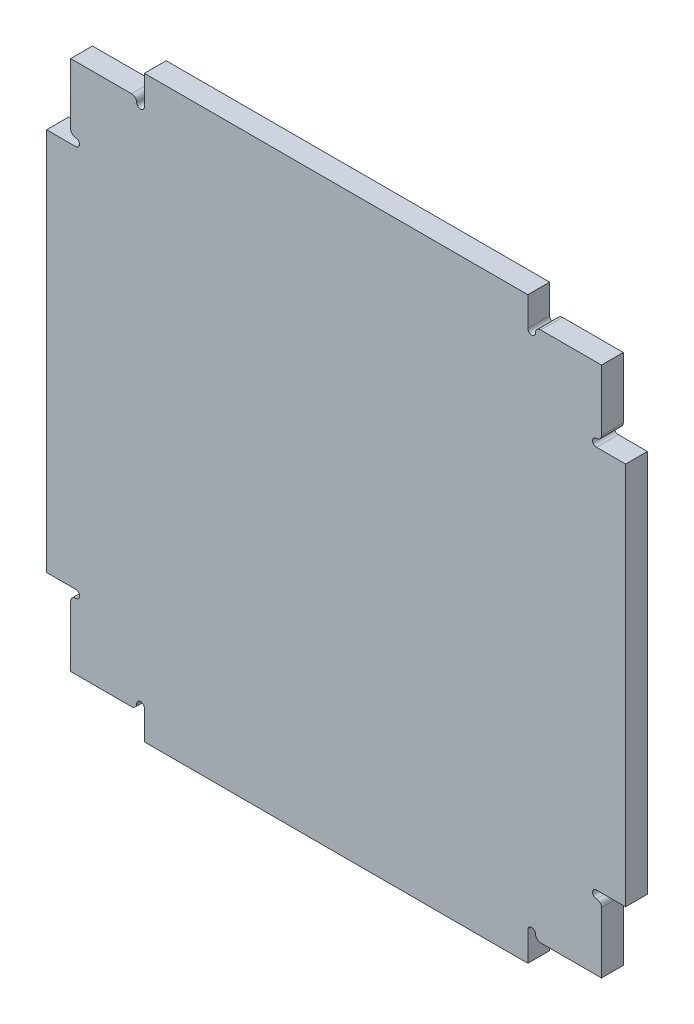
ISO-10303-21;
HEADER;
FILE_DESCRIPTION(('STEP AP214'),'2;1');
FILE_NAME('part.step','',(''),(''),'','','');
FILE_SCHEMA(('AUTOMOTIVE_DESIGN { 1 0 10303 214 1 1 1 1 }'));
ENDSEC;
DATA;
#1=APPLICATION_CONTEXT('core data for automotive mechanical design processes');
#2=APPLICATION_PROTOCOL_DEFINITION('international standard','automotive_design',2000,#1);
#3=PRODUCT_CONTEXT('',#1,'mechanical');
#4=PRODUCT('Part','Part','',(#3));
#5=PRODUCT_RELATED_PRODUCT_CATEGORY('part','',(#4));
#6=PRODUCT_DEFINITION_FORMATION('','',#4);
#7=PRODUCT_DEFINITION_CONTEXT('part definition',#1,'design');
#8=PRODUCT_DEFINITION('design','',#6,#7);
#9=PRODUCT_DEFINITION_SHAPE('','',#8);
#10=(LENGTH_UNIT() NAMED_UNIT(*) SI_UNIT(.MILLI.,.METRE.));
#11=(NAMED_UNIT(*) PLANE_ANGLE_UNIT() SI_UNIT($,.RADIAN.));
#12=(NAMED_UNIT(*) SI_UNIT($,.STERADIAN.) SOLID_ANGLE_UNIT());
#13=UNCERTAINTY_MEASURE_WITH_UNIT(LENGTH_MEASURE(1.E-05),#10,'distance_accuracy_value','');
#14=(GEOMETRIC_REPRESENTATION_CONTEXT(3) GLOBAL_UNCERTAINTY_ASSIGNED_CONTEXT((#13)) GLOBAL_UNIT_ASSIGNED_CONTEXT((#10,
#11,#12)) REPRESENTATION_CONTEXT('',''));
#15=CARTESIAN_POINT('',(0.,0.,0.));
#16=DIRECTION('',(0.,0.,1.));
#17=DIRECTION('',(1.,0.,0.));
#18=AXIS2_PLACEMENT_3D('',#15,#16,#17);
#19=CARTESIAN_POINT('',(-207.509638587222,0.,17.));
#20=DIRECTION('',(1.,0.,0.));
#21=DIRECTION('',(0.,0.,-1.));
#22=AXIS2_PLACEMENT_3D('',#19,#20,#21);
#23=PLANE('',#22);
#24=DIRECTION('',(0.,-1.,0.));
#25=VECTOR('',#24,1.);
#26=CARTESIAN_POINT('',(-207.509638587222,0.,0.));
#27=LINE('',#26,#25);
#28=CARTESIAN_POINT('',(-207.509638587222,-412.621529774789,0.));
#29=VERTEX_POINT('',#28);
#30=CARTESIAN_POINT('',(-207.509638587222,-460.121529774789,0.));
#31=VERTEX_POINT('',#30);
#32=EDGE_CURVE('E297',#29,#31,#27,.T.);
#33=ORIENTED_EDGE('',*,*,#32,.T.);
#34=DIRECTION('',(0.,0.,-1.));
#35=VECTOR('',#34,1.);
#36=CARTESIAN_POINT('',(-207.509638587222,-460.121529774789,17.));
#37=LINE('',#36,#35);
#38=CARTESIAN_POINT('',(-207.509638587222,-460.121529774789,17.));
#39=VERTEX_POINT('',#38);
#40=EDGE_CURVE('E11',#39,#31,#37,.T.);
#41=ORIENTED_EDGE('',*,*,#40,.F.);
#42=DIRECTION('',(0.,-1.,0.));
#43=VECTOR('',#42,1.);
#44=CARTESIAN_POINT('',(-207.509638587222,0.,17.));
#45=LINE('',#44,#43);
#46=CARTESIAN_POINT('',(-207.509638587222,-412.621529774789,17.));
#47=VERTEX_POINT('',#46);
#48=EDGE_CURVE('E393',#47,#39,#45,.T.);
#49=ORIENTED_EDGE('',*,*,#48,.F.);
#50=DIRECTION('',(0.,0.,-1.));
#51=VECTOR('',#50,1.);
#52=CARTESIAN_POINT('',(-207.509638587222,-412.621529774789,17.));
#53=LINE('',#52,#51);
#54=EDGE_CURVE('E293',#47,#29,#53,.T.);
#55=ORIENTED_EDGE('',*,*,#54,.T.);
#56=EDGE_LOOP('',(#33,#41,#49,#55));
#57=FACE_BOUND('',#56,.T.);
#58=ADVANCED_FACE('F34',(#57),#23,.F.);
#59=CARTESIAN_POINT('',(0.,-460.121529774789,17.));
#60=DIRECTION('',(0.,1.,0.));
#61=DIRECTION('',(0.,0.,1.));
#62=AXIS2_PLACEMENT_3D('',#59,#60,#61);
#63=PLANE('',#62);
#64=DIRECTION('',(1.,0.,0.));
#65=VECTOR('',#64,1.);
#66=CARTESIAN_POINT('',(0.,-460.121529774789,0.));
#67=LINE('',#66,#65);
#68=CARTESIAN_POINT('',(-160.009638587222,-460.121529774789,0.));
#69=VERTEX_POINT('',#68);
#70=EDGE_CURVE('E300',#31,#69,#67,.T.);
#71=ORIENTED_EDGE('',*,*,#70,.T.);
#72=DIRECTION('',(0.,0.,-1.));
#73=VECTOR('',#72,1.);
#74=CARTESIAN_POINT('',(-160.009638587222,-460.121529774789,17.));
#75=LINE('',#74,#73);
#76=CARTESIAN_POINT('',(-160.009638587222,-460.121529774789,17.));
#77=VERTEX_POINT('',#76);
#78=EDGE_CURVE('E42',#77,#69,#75,.T.);
#79=ORIENTED_EDGE('',*,*,#78,.F.);
#80=DIRECTION('',(1.,0.,0.));
#81=VECTOR('',#80,1.);
#82=CARTESIAN_POINT('',(0.,-460.121529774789,17.));
#83=LINE('',#82,#81);
#84=EDGE_CURVE('E173',#39,#77,#83,.T.);
#85=ORIENTED_EDGE('',*,*,#84,.F.);
#86=ORIENTED_EDGE('',*,*,#40,.T.);
#87=EDGE_LOOP('',(#71,#79,#85,#86));
#88=FACE_BOUND('',#87,.T.);
#89=ADVANCED_FACE('F577',(#88),#63,.F.);
#90=CARTESIAN_POINT('',(-160.009638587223,-456.16447714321,17.));
#91=DIRECTION('',(0.,0.,-1.));
#92=DIRECTION('',(-1.,0.,0.));
#93=AXIS2_PLACEMENT_3D('',#90,#91,#92);
#94=CYLINDRICAL_SURFACE('',#93,3.95705263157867);
#95=CARTESIAN_POINT('',(-160.009638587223,-456.16447714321,0.));
#96=DIRECTION('',(0.,0.,1.));
#97=DIRECTION('',(1.,0.,0.));
#98=AXIS2_PLACEMENT_3D('',#95,#96,#97);
#99=CIRCLE('',#98,3.95705263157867);
#100=CARTESIAN_POINT('',(-156.052585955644,-456.16447714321,0.));
#101=VERTEX_POINT('',#100);
#102=EDGE_CURVE('E302',#69,#101,#99,.T.);
#103=ORIENTED_EDGE('',*,*,#102,.T.);
#104=DIRECTION('',(0.,0.,-1.));
#105=VECTOR('',#104,1.);
#106=CARTESIAN_POINT('',(-156.052585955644,-456.16447714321,17.));
#107=LINE('',#106,#105);
#108=CARTESIAN_POINT('',(-156.052585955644,-456.16447714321,17.));
#109=VERTEX_POINT('',#108);
#110=EDGE_CURVE('E460',#109,#101,#107,.T.);
#111=ORIENTED_EDGE('',*,*,#110,.F.);
#112=CARTESIAN_POINT('',(-160.009638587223,-456.16447714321,17.));
#113=DIRECTION('',(0.,0.,1.));
#114=DIRECTION('',(1.,0.,0.));
#115=AXIS2_PLACEMENT_3D('',#112,#113,#114);
#116=CIRCLE('',#115,3.95705263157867);
#117=EDGE_CURVE('E467',#77,#109,#116,.T.);
#118=ORIENTED_EDGE('',*,*,#117,.F.);
#119=ORIENTED_EDGE('',*,*,#78,.T.);
#120=EDGE_LOOP('',(#103,#111,#118,#119));
#121=FACE_BOUND('',#120,.T.);
#122=ADVANCED_FACE('F465',(#121),#94,.T.);
#123=CARTESIAN_POINT('',(-153.052585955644,-456.16447714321,17.));
#124=DIRECTION('',(0.,0.,-1.));
#125=DIRECTION('',(-1.,0.,0.));
#126=AXIS2_PLACEMENT_3D('',#123,#124,#125);
#127=CYLINDRICAL_SURFACE('',#126,3.);
#128=CARTESIAN_POINT('',(-153.052585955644,-456.16447714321,0.));
#129=DIRECTION('',(0.,0.,1.));
#130=DIRECTION('',(1.,0.,0.));
#131=AXIS2_PLACEMENT_3D('',#128,#129,#130);
#132=CIRCLE('',#131,3.);
#133=CARTESIAN_POINT('',(-150.052585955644,-456.16447714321,0.));
#134=VERTEX_POINT('',#133);
#135=EDGE_CURVE('E305',#134,#101,#132,.T.);
#136=ORIENTED_EDGE('',*,*,#135,.F.);
#137=DIRECTION('',(0.,0.,-1.));
#138=VECTOR('',#137,1.);
#139=CARTESIAN_POINT('',(-150.052585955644,-456.16447714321,17.));
#140=LINE('',#139,#138);
#141=CARTESIAN_POINT('',(-150.052585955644,-456.16447714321,17.));
#142=VERTEX_POINT('',#141);
#143=EDGE_CURVE('E458',#142,#134,#140,.T.);
#144=ORIENTED_EDGE('',*,*,#143,.F.);
#145=CARTESIAN_POINT('',(-153.052585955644,-456.16447714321,17.));
#146=DIRECTION('',(0.,0.,1.));
#147=DIRECTION('',(1.,0.,0.));
#148=AXIS2_PLACEMENT_3D('',#145,#146,#147);
#149=CIRCLE('',#148,3.);
#150=EDGE_CURVE('E478',#142,#109,#149,.T.);
#151=ORIENTED_EDGE('',*,*,#150,.T.);
#152=ORIENTED_EDGE('',*,*,#110,.T.);
#153=EDGE_LOOP('',(#136,#144,#151,#152));
#154=FACE_BOUND('',#153,.T.);
#155=ADVANCED_FACE('F474',(#154),#127,.F.);
#156=CARTESIAN_POINT('',(-150.052585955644,0.,17.));
#157=DIRECTION('',(1.,0.,0.));
#158=DIRECTION('',(0.,0.,-1.));
#159=AXIS2_PLACEMENT_3D('',#156,#157,#158);
#160=PLANE('',#159);
#161=DIRECTION('',(0.,-1.,0.));
#162=VECTOR('',#161,1.);
#163=CARTESIAN_POINT('',(-150.052585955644,0.,0.));
#164=LINE('',#163,#162);
#165=CARTESIAN_POINT('',(-150.052585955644,-478.917529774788,0.));
#166=VERTEX_POINT('',#165);
#167=EDGE_CURVE('E308',#134,#166,#164,.T.);
#168=ORIENTED_EDGE('',*,*,#167,.T.);
#169=DIRECTION('',(0.,0.,-1.));
#170=VECTOR('',#169,1.);
#171=CARTESIAN_POINT('',(-150.052585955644,-478.917529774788,17.));
#172=LINE('',#171,#170);
#173=CARTESIAN_POINT('',(-150.052585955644,-478.917529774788,17.));
#174=VERTEX_POINT('',#173);
#175=EDGE_CURVE('E456',#174,#166,#172,.T.);
#176=ORIENTED_EDGE('',*,*,#175,.F.);
#177=DIRECTION('',(0.,-1.,0.));
#178=VECTOR('',#177,1.);
#179=CARTESIAN_POINT('',(-150.052585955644,0.,17.));
#180=LINE('',#179,#178);
#181=EDGE_CURVE('E479',#142,#174,#180,.T.);
#182=ORIENTED_EDGE('',*,*,#181,.F.);
#183=ORIENTED_EDGE('',*,*,#143,.T.);
#184=EDGE_LOOP('',(#168,#176,#182,#183));
#185=FACE_BOUND('',#184,.T.);
#186=ADVANCED_FACE('F588',(#185),#160,.F.);
#187=CARTESIAN_POINT('',(0.,-478.917529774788,17.));
#188=DIRECTION('',(0.,-1.,0.));
#189=DIRECTION('',(0.,0.,-1.));
#190=AXIS2_PLACEMENT_3D('',#187,#188,#189);
#191=PLANE('',#190);
#192=DIRECTION('',(-1.,0.,0.));
#193=VECTOR('',#192,1.);
#194=CARTESIAN_POINT('',(0.,-478.917529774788,0.));
#195=LINE('',#194,#193);
#196=CARTESIAN_POINT('',(148.947414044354,-478.917529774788,0.));
#197=VERTEX_POINT('',#196);
#198=EDGE_CURVE('E311',#197,#166,#195,.T.);
#199=ORIENTED_EDGE('',*,*,#198,.F.);
#200=DIRECTION('',(0.,0.,-1.));
#201=VECTOR('',#200,1.);
#202=CARTESIAN_POINT('',(148.947414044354,-478.917529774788,17.));
#203=LINE('',#202,#201);
#204=CARTESIAN_POINT('',(148.947414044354,-478.917529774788,17.));
#205=VERTEX_POINT('',#204);
#206=EDGE_CURVE('E454',#205,#197,#203,.T.);
#207=ORIENTED_EDGE('',*,*,#206,.F.);
#208=DIRECTION('',(-1.,0.,0.));
#209=VECTOR('',#208,1.);
#210=CARTESIAN_POINT('',(0.,-478.917529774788,17.));
#211=LINE('',#210,#209);
#212=EDGE_CURVE('E481',#205,#174,#211,.T.);
#213=ORIENTED_EDGE('',*,*,#212,.T.);
#214=ORIENTED_EDGE('',*,*,#175,.T.);
#215=EDGE_LOOP('',(#199,#207,#213,#214));
#216=FACE_BOUND('',#215,.T.);
#217=ADVANCED_FACE('F591',(#216),#191,.T.);
#218=CARTESIAN_POINT('',(148.947414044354,0.,17.));
#219=DIRECTION('',(1.,0.,0.));
#220=DIRECTION('',(0.,0.,-1.));
#221=AXIS2_PLACEMENT_3D('',#218,#219,#220);
#222=PLANE('',#221);
#223=DIRECTION('',(0.,-1.,0.));
#224=VECTOR('',#223,1.);
#225=CARTESIAN_POINT('',(148.947414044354,0.,0.));
#226=LINE('',#225,#224);
#227=CARTESIAN_POINT('',(148.947414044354,-456.16447714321,0.));
#228=VERTEX_POINT('',#227);
#229=EDGE_CURVE('E314',#228,#197,#226,.T.);
#230=ORIENTED_EDGE('',*,*,#229,.F.);
#231=DIRECTION('',(0.,0.,-1.));
#232=VECTOR('',#231,1.);
#233=CARTESIAN_POINT('',(148.947414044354,-456.16447714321,17.));
#234=LINE('',#233,#232);
#235=CARTESIAN_POINT('',(148.947414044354,-456.16447714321,17.));
#236=VERTEX_POINT('',#235);
#237=EDGE_CURVE('E452',#236,#228,#234,.T.);
#238=ORIENTED_EDGE('',*,*,#237,.F.);
#239=DIRECTION('',(0.,-1.,0.));
#240=VECTOR('',#239,1.);
#241=CARTESIAN_POINT('',(148.947414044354,0.,17.));
#242=LINE('',#241,#240);
#243=EDGE_CURVE('E488',#236,#205,#242,.T.);
#244=ORIENTED_EDGE('',*,*,#243,.T.);
#245=ORIENTED_EDGE('',*,*,#206,.T.);
#246=EDGE_LOOP('',(#230,#238,#244,#245));
#247=FACE_BOUND('',#246,.T.);
#248=ADVANCED_FACE('F595',(#247),#222,.T.);
#249=CARTESIAN_POINT('',(151.947414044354,-456.16447714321,17.));
#250=DIRECTION('',(0.,0.,-1.));
#251=DIRECTION('',(-1.,0.,0.));
#252=AXIS2_PLACEMENT_3D('',#249,#250,#251);
#253=CYLINDRICAL_SURFACE('',#252,3.);
#254=CARTESIAN_POINT('',(151.947414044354,-456.16447714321,0.));
#255=DIRECTION('',(0.,0.,1.));
#256=DIRECTION('',(1.,0.,0.));
#257=AXIS2_PLACEMENT_3D('',#254,#255,#256);
#258=CIRCLE('',#257,3.);
#259=CARTESIAN_POINT('',(154.947414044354,-456.16447714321,0.));
#260=VERTEX_POINT('',#259);
#261=EDGE_CURVE('E317',#228,#260,#258,.F.);
#262=ORIENTED_EDGE('',*,*,#261,.T.);
#263=DIRECTION('',(0.,0.,-1.));
#264=VECTOR('',#263,1.);
#265=CARTESIAN_POINT('',(154.947414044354,-456.16447714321,17.));
#266=LINE('',#265,#264);
#267=CARTESIAN_POINT('',(154.947414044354,-456.16447714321,17.));
#268=VERTEX_POINT('',#267);
#269=EDGE_CURVE('E450',#268,#260,#266,.T.);
#270=ORIENTED_EDGE('',*,*,#269,.F.);
#271=CARTESIAN_POINT('',(151.947414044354,-456.16447714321,17.));
#272=DIRECTION('',(0.,0.,1.));
#273=DIRECTION('',(1.,0.,0.));
#274=AXIS2_PLACEMENT_3D('',#271,#272,#273);
#275=CIRCLE('',#274,3.);
#276=EDGE_CURVE('E491',#236,#268,#275,.F.);
#277=ORIENTED_EDGE('',*,*,#276,.F.);
#278=ORIENTED_EDGE('',*,*,#237,.T.);
#279=EDGE_LOOP('',(#262,#270,#277,#278));
#280=FACE_BOUND('',#279,.T.);
#281=ADVANCED_FACE('F599',(#280),#253,.F.);
#282=CARTESIAN_POINT('',(158.904466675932,-456.16447714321,17.));
#283=DIRECTION('',(0.,0.,-1.));
#284=DIRECTION('',(-1.,0.,0.));
#285=AXIS2_PLACEMENT_3D('',#282,#283,#284);
#286=CYLINDRICAL_SURFACE('',#285,3.95705263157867);
#287=CARTESIAN_POINT('',(158.904466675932,-456.16447714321,0.));
#288=DIRECTION('',(0.,0.,1.));
#289=DIRECTION('',(1.,0.,0.));
#290=AXIS2_PLACEMENT_3D('',#287,#288,#289);
#291=CIRCLE('',#290,3.95705263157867);
#292=CARTESIAN_POINT('',(158.904466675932,-460.121529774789,0.));
#293=VERTEX_POINT('',#292);
#294=EDGE_CURVE('E320',#293,#260,#291,.F.);
#295=ORIENTED_EDGE('',*,*,#294,.F.);
#296=DIRECTION('',(0.,0.,-1.));
#297=VECTOR('',#296,1.);
#298=CARTESIAN_POINT('',(158.904466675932,-460.121529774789,17.));
#299=LINE('',#298,#297);
#300=CARTESIAN_POINT('',(158.904466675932,-460.121529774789,17.));
#301=VERTEX_POINT('',#300);
#302=EDGE_CURVE('E448',#301,#293,#299,.T.);
#303=ORIENTED_EDGE('',*,*,#302,.F.);
#304=CARTESIAN_POINT('',(158.904466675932,-456.16447714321,17.));
#305=DIRECTION('',(0.,0.,1.));
#306=DIRECTION('',(1.,0.,0.));
#307=AXIS2_PLACEMENT_3D('',#304,#305,#306);
#308=CIRCLE('',#307,3.95705263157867);
#309=EDGE_CURVE('E493',#301,#268,#308,.F.);
#310=ORIENTED_EDGE('',*,*,#309,.T.);
#311=ORIENTED_EDGE('',*,*,#269,.T.);
#312=EDGE_LOOP('',(#295,#303,#310,#311));
#313=FACE_BOUND('',#312,.T.);
#314=ADVANCED_FACE('F603',(#313),#286,.T.);
#315=CARTESIAN_POINT('',(0.,-460.121529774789,17.));
#316=DIRECTION('',(0.,-1.,0.));
#317=DIRECTION('',(0.,0.,-1.));
#318=AXIS2_PLACEMENT_3D('',#315,#316,#317);
#319=PLANE('',#318);
#320=DIRECTION('',(-1.,0.,0.));
#321=VECTOR('',#320,1.);
#322=CARTESIAN_POINT('',(0.,-460.121529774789,0.));
#323=LINE('',#322,#321);
#324=CARTESIAN_POINT('',(206.404466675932,-460.121529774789,0.));
#325=VERTEX_POINT('',#324);
#326=EDGE_CURVE('E323',#325,#293,#323,.T.);
#327=ORIENTED_EDGE('',*,*,#326,.F.);
#328=DIRECTION('',(0.,0.,-1.));
#329=VECTOR('',#328,1.);
#330=CARTESIAN_POINT('',(206.404466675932,-460.121529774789,17.));
#331=LINE('',#330,#329);
#332=CARTESIAN_POINT('',(206.404466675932,-460.121529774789,17.));
#333=VERTEX_POINT('',#332);
#334=EDGE_CURVE('E446',#333,#325,#331,.T.);
#335=ORIENTED_EDGE('',*,*,#334,.F.);
#336=DIRECTION('',(-1.,0.,0.));
#337=VECTOR('',#336,1.);
#338=CARTESIAN_POINT('',(0.,-460.121529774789,17.));
#339=LINE('',#338,#337);
#340=EDGE_CURVE('E496',#333,#301,#339,.T.);
#341=ORIENTED_EDGE('',*,*,#340,.T.);
#342=ORIENTED_EDGE('',*,*,#302,.T.);
#343=EDGE_LOOP('',(#327,#335,#341,#342));
#344=FACE_BOUND('',#343,.T.);
#345=ADVANCED_FACE('F607',(#344),#319,.T.);
#346=CARTESIAN_POINT('',(206.404466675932,0.,17.));
#347=DIRECTION('',(1.,0.,0.));
#348=DIRECTION('',(0.,0.,-1.));
#349=AXIS2_PLACEMENT_3D('',#346,#347,#348);
#350=PLANE('',#349);
#351=DIRECTION('',(0.,-1.,0.));
#352=VECTOR('',#351,1.);
#353=CARTESIAN_POINT('',(206.404466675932,0.,0.));
#354=LINE('',#353,#352);
#355=CARTESIAN_POINT('',(206.404466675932,-412.621529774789,0.));
#356=VERTEX_POINT('',#355);
#357=EDGE_CURVE('E326',#356,#325,#354,.T.);
#358=ORIENTED_EDGE('',*,*,#357,.F.);
#359=DIRECTION('',(0.,0.,-1.));
#360=VECTOR('',#359,1.);
#361=CARTESIAN_POINT('',(206.404466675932,-412.621529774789,17.));
#362=LINE('',#361,#360);
#363=CARTESIAN_POINT('',(206.404466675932,-412.621529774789,17.));
#364=VERTEX_POINT('',#363);
#365=EDGE_CURVE('E444',#364,#356,#362,.T.);
#366=ORIENTED_EDGE('',*,*,#365,.F.);
#367=DIRECTION('',(0.,-1.,0.));
#368=VECTOR('',#367,1.);
#369=CARTESIAN_POINT('',(206.404466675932,0.,17.));
#370=LINE('',#369,#368);
#371=EDGE_CURVE('E499',#364,#333,#370,.T.);
#372=ORIENTED_EDGE('',*,*,#371,.T.);
#373=ORIENTED_EDGE('',*,*,#334,.T.);
#374=EDGE_LOOP('',(#358,#366,#372,#373));
#375=FACE_BOUND('',#374,.T.);
#376=ADVANCED_FACE('F611',(#375),#350,.T.);
#377=CARTESIAN_POINT('',(202.447414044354,-412.621529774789,17.));
#378=DIRECTION('',(0.,0.,-1.));
#379=DIRECTION('',(-1.,0.,0.));
#380=AXIS2_PLACEMENT_3D('',#377,#378,#379);
#381=CYLINDRICAL_SURFACE('',#380,3.95705263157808);
#382=CARTESIAN_POINT('',(202.447414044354,-412.621529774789,0.));
#383=DIRECTION('',(0.,0.,1.));
#384=DIRECTION('',(1.,0.,0.));
#385=AXIS2_PLACEMENT_3D('',#382,#383,#384);
#386=CIRCLE('',#385,3.95705263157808);
#387=CARTESIAN_POINT('',(202.447414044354,-408.664477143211,0.));
#388=VERTEX_POINT('',#387);
#389=EDGE_CURVE('E329',#388,#356,#386,.F.);
#390=ORIENTED_EDGE('',*,*,#389,.F.);
#391=DIRECTION('',(0.,0.,-1.));
#392=VECTOR('',#391,1.);
#393=CARTESIAN_POINT('',(202.447414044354,-408.664477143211,17.));
#394=LINE('',#393,#392);
#395=CARTESIAN_POINT('',(202.447414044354,-408.664477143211,17.));
#396=VERTEX_POINT('',#395);
#397=EDGE_CURVE('E442',#396,#388,#394,.T.);
#398=ORIENTED_EDGE('',*,*,#397,.F.);
#399=CARTESIAN_POINT('',(202.447414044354,-412.621529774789,17.));
#400=DIRECTION('',(0.,0.,1.));
#401=DIRECTION('',(1.,0.,0.));
#402=AXIS2_PLACEMENT_3D('',#399,#400,#401);
#403=CIRCLE('',#402,3.95705263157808);
#404=EDGE_CURVE('E502',#396,#364,#403,.F.);
#405=ORIENTED_EDGE('',*,*,#404,.T.);
#406=ORIENTED_EDGE('',*,*,#365,.T.);
#407=EDGE_LOOP('',(#390,#398,#405,#406));
#408=FACE_BOUND('',#407,.T.);
#409=ADVANCED_FACE('F615',(#408),#381,.T.);
#410=CARTESIAN_POINT('',(202.447414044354,-405.664477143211,17.));
#411=DIRECTION('',(0.,0.,-1.));
#412=DIRECTION('',(-1.,0.,0.));
#413=AXIS2_PLACEMENT_3D('',#410,#411,#412);
#414=CYLINDRICAL_SURFACE('',#413,3.);
#415=CARTESIAN_POINT('',(202.447414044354,-405.664477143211,0.));
#416=DIRECTION('',(0.,0.,1.));
#417=DIRECTION('',(1.,0.,0.));
#418=AXIS2_PLACEMENT_3D('',#415,#416,#417);
#419=CIRCLE('',#418,3.);
#420=CARTESIAN_POINT('',(202.447414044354,-402.664477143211,0.));
#421=VERTEX_POINT('',#420);
#422=EDGE_CURVE('E332',#388,#421,#419,.F.);
#423=ORIENTED_EDGE('',*,*,#422,.T.);
#424=DIRECTION('',(0.,0.,-1.));
#425=VECTOR('',#424,1.);
#426=CARTESIAN_POINT('',(202.447414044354,-402.664477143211,17.));
#427=LINE('',#426,#425);
#428=CARTESIAN_POINT('',(202.447414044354,-402.664477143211,17.));
#429=VERTEX_POINT('',#428);
#430=EDGE_CURVE('E440',#429,#421,#427,.T.);
#431=ORIENTED_EDGE('',*,*,#430,.F.);
#432=CARTESIAN_POINT('',(202.447414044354,-405.664477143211,17.));
#433=DIRECTION('',(0.,0.,1.));
#434=DIRECTION('',(1.,0.,0.));
#435=AXIS2_PLACEMENT_3D('',#432,#433,#434);
#436=CIRCLE('',#435,3.);
#437=EDGE_CURVE('E505',#396,#429,#436,.F.);
#438=ORIENTED_EDGE('',*,*,#437,.F.);
#439=ORIENTED_EDGE('',*,*,#397,.T.);
#440=EDGE_LOOP('',(#423,#431,#438,#439));
#441=FACE_BOUND('',#440,.T.);
#442=ADVANCED_FACE('F619',(#441),#414,.F.);
#443=CARTESIAN_POINT('',(0.,-402.664477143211,17.));
#444=DIRECTION('',(0.,-1.,0.));
#445=DIRECTION('',(0.,0.,-1.));
#446=AXIS2_PLACEMENT_3D('',#443,#444,#445);
#447=PLANE('',#446);
#448=DIRECTION('',(-1.,0.,0.));
#449=VECTOR('',#448,1.);
#450=CARTESIAN_POINT('',(0.,-402.664477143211,0.));
#451=LINE('',#450,#449);
#452=CARTESIAN_POINT('',(225.200466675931,-402.664477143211,0.));
#453=VERTEX_POINT('',#452);
#454=EDGE_CURVE('E335',#453,#421,#451,.T.);
#455=ORIENTED_EDGE('',*,*,#454,.F.);
#456=DIRECTION('',(0.,0.,-1.));
#457=VECTOR('',#456,1.);
#458=CARTESIAN_POINT('',(225.200466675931,-402.664477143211,17.));
#459=LINE('',#458,#457);
#460=CARTESIAN_POINT('',(225.200466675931,-402.664477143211,17.));
#461=VERTEX_POINT('',#460);
#462=EDGE_CURVE('E438',#461,#453,#459,.T.);
#463=ORIENTED_EDGE('',*,*,#462,.F.);
#464=DIRECTION('',(-1.,0.,0.));
#465=VECTOR('',#464,1.);
#466=CARTESIAN_POINT('',(0.,-402.664477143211,17.));
#467=LINE('',#466,#465);
#468=EDGE_CURVE('E507',#461,#429,#467,.T.);
#469=ORIENTED_EDGE('',*,*,#468,.T.);
#470=ORIENTED_EDGE('',*,*,#430,.T.);
#471=EDGE_LOOP('',(#455,#463,#469,#470));
#472=FACE_BOUND('',#471,.T.);
#473=ADVANCED_FACE('F623',(#472),#447,.T.);
#474=CARTESIAN_POINT('',(225.200466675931,0.,17.));
#475=DIRECTION('',(1.,0.,0.));
#476=DIRECTION('',(0.,0.,-1.));
#477=AXIS2_PLACEMENT_3D('',#474,#475,#476);
#478=PLANE('',#477);
#479=DIRECTION('',(0.,-1.,0.));
#480=VECTOR('',#479,1.);
#481=CARTESIAN_POINT('',(225.200466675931,0.,0.));
#482=LINE('',#481,#480);
#483=CARTESIAN_POINT('',(225.200466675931,-103.664477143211,0.));
#484=VERTEX_POINT('',#483);
#485=EDGE_CURVE('E338',#484,#453,#482,.T.);
#486=ORIENTED_EDGE('',*,*,#485,.F.);
#487=DIRECTION('',(0.,0.,-1.));
#488=VECTOR('',#487,1.);
#489=CARTESIAN_POINT('',(225.200466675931,-103.664477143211,17.));
#490=LINE('',#489,#488);
#491=CARTESIAN_POINT('',(225.200466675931,-103.664477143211,17.));
#492=VERTEX_POINT('',#491);
#493=EDGE_CURVE('E436',#492,#484,#490,.T.);
#494=ORIENTED_EDGE('',*,*,#493,.F.);
#495=DIRECTION('',(0.,-1.,0.));
#496=VECTOR('',#495,1.);
#497=CARTESIAN_POINT('',(225.200466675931,0.,17.));
#498=LINE('',#497,#496);
#499=EDGE_CURVE('E510',#492,#461,#498,.T.);
#500=ORIENTED_EDGE('',*,*,#499,.T.);
#501=ORIENTED_EDGE('',*,*,#462,.T.);
#502=EDGE_LOOP('',(#486,#494,#500,#501));
#503=FACE_BOUND('',#502,.T.);
#504=ADVANCED_FACE('F627',(#503),#478,.T.);
#505=CARTESIAN_POINT('',(0.,-103.664477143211,17.));
#506=DIRECTION('',(0.,1.,0.));
#507=DIRECTION('',(0.,0.,1.));
#508=AXIS2_PLACEMENT_3D('',#505,#506,#507);
#509=PLANE('',#508);
#510=DIRECTION('',(1.,0.,0.));
#511=VECTOR('',#510,1.);
#512=CARTESIAN_POINT('',(0.,-103.664477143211,0.));
#513=LINE('',#512,#511);
#514=CARTESIAN_POINT('',(202.447414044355,-103.664477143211,0.));
#515=VERTEX_POINT('',#514);
#516=EDGE_CURVE('E341',#515,#484,#513,.T.);
#517=ORIENTED_EDGE('',*,*,#516,.F.);
#518=DIRECTION('',(0.,0.,-1.));
#519=VECTOR('',#518,1.);
#520=CARTESIAN_POINT('',(202.447414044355,-103.664477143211,17.));
#521=LINE('',#520,#519);
#522=CARTESIAN_POINT('',(202.447414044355,-103.664477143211,17.));
#523=VERTEX_POINT('',#522);
#524=EDGE_CURVE('E434',#523,#515,#521,.T.);
#525=ORIENTED_EDGE('',*,*,#524,.F.);
#526=DIRECTION('',(1.,0.,0.));
#527=VECTOR('',#526,1.);
#528=CARTESIAN_POINT('',(0.,-103.664477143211,17.));
#529=LINE('',#528,#527);
#530=EDGE_CURVE('E513',#523,#492,#529,.T.);
#531=ORIENTED_EDGE('',*,*,#530,.T.);
#532=ORIENTED_EDGE('',*,*,#493,.T.);
#533=EDGE_LOOP('',(#517,#525,#531,#532));
#534=FACE_BOUND('',#533,.T.);
#535=ADVANCED_FACE('F631',(#534),#509,.T.);
#536=CARTESIAN_POINT('',(202.447414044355,-100.664477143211,17.));
#537=DIRECTION('',(0.,0.,-1.));
#538=DIRECTION('',(-1.,0.,0.));
#539=AXIS2_PLACEMENT_3D('',#536,#537,#538);
#540=CYLINDRICAL_SURFACE('',#539,3.);
#541=CARTESIAN_POINT('',(202.447414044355,-100.664477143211,0.));
#542=DIRECTION('',(0.,0.,1.));
#543=DIRECTION('',(1.,0.,0.));
#544=AXIS2_PLACEMENT_3D('',#541,#542,#543);
#545=CIRCLE('',#544,3.);
#546=CARTESIAN_POINT('',(202.447414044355,-97.6644771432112,0.));
#547=VERTEX_POINT('',#546);
#548=EDGE_CURVE('E344',#515,#547,#545,.F.);
#549=ORIENTED_EDGE('',*,*,#548,.T.);
#550=DIRECTION('',(0.,0.,-1.));
#551=VECTOR('',#550,1.);
#552=CARTESIAN_POINT('',(202.447414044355,-97.6644771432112,17.));
#553=LINE('',#552,#551);
#554=CARTESIAN_POINT('',(202.447414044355,-97.6644771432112,17.));
#555=VERTEX_POINT('',#554);
#556=EDGE_CURVE('E432',#555,#547,#553,.T.);
#557=ORIENTED_EDGE('',*,*,#556,.F.);
#558=CARTESIAN_POINT('',(202.447414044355,-100.664477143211,17.));
#559=DIRECTION('',(0.,0.,1.));
#560=DIRECTION('',(1.,0.,0.));
#561=AXIS2_PLACEMENT_3D('',#558,#559,#560);
#562=CIRCLE('',#561,3.);
#563=EDGE_CURVE('E516',#523,#555,#562,.F.);
#564=ORIENTED_EDGE('',*,*,#563,.F.);
#565=ORIENTED_EDGE('',*,*,#524,.T.);
#566=EDGE_LOOP('',(#549,#557,#564,#565));
#567=FACE_BOUND('',#566,.T.);
#568=ADVANCED_FACE('F635',(#567),#540,.F.);
#569=CARTESIAN_POINT('',(202.447414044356,-93.707424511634,17.));
#570=DIRECTION('',(0.,0.,-1.));
#571=DIRECTION('',(-1.,0.,0.));
#572=AXIS2_PLACEMENT_3D('',#569,#570,#571);
#573=CYLINDRICAL_SURFACE('',#572,3.95705263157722);
#574=CARTESIAN_POINT('',(202.447414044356,-93.707424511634,0.));
#575=DIRECTION('',(0.,0.,1.));
#576=DIRECTION('',(1.,0.,0.));
#577=AXIS2_PLACEMENT_3D('',#574,#575,#576);
#578=CIRCLE('',#577,3.95705263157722);
#579=CARTESIAN_POINT('',(206.404466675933,-93.7074245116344,0.));
#580=VERTEX_POINT('',#579);
#581=EDGE_CURVE('E347',#580,#547,#578,.F.);
#582=ORIENTED_EDGE('',*,*,#581,.F.);
#583=DIRECTION('',(0.,0.,-1.));
#584=VECTOR('',#583,1.);
#585=CARTESIAN_POINT('',(206.404466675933,-93.7074245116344,17.));
#586=LINE('',#585,#584);
#587=CARTESIAN_POINT('',(206.404466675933,-93.7074245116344,17.));
#588=VERTEX_POINT('',#587);
#589=EDGE_CURVE('E430',#588,#580,#586,.T.);
#590=ORIENTED_EDGE('',*,*,#589,.F.);
#591=CARTESIAN_POINT('',(202.447414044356,-93.707424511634,17.));
#592=DIRECTION('',(0.,0.,1.));
#593=DIRECTION('',(1.,0.,0.));
#594=AXIS2_PLACEMENT_3D('',#591,#592,#593);
#595=CIRCLE('',#594,3.95705263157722);
#596=EDGE_CURVE('E518',#588,#555,#595,.F.);
#597=ORIENTED_EDGE('',*,*,#596,.T.);
#598=ORIENTED_EDGE('',*,*,#556,.T.);
#599=EDGE_LOOP('',(#582,#590,#597,#598));
#600=FACE_BOUND('',#599,.T.);
#601=ADVANCED_FACE('F639',(#600),#573,.T.);
#602=CARTESIAN_POINT('',(206.404466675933,0.,17.));
#603=DIRECTION('',(1.,0.,0.));
#604=DIRECTION('',(0.,0.,-1.));
#605=AXIS2_PLACEMENT_3D('',#602,#603,#604);
#606=PLANE('',#605);
#607=DIRECTION('',(0.,-1.,0.));
#608=VECTOR('',#607,1.);
#609=CARTESIAN_POINT('',(206.404466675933,0.,0.));
#610=LINE('',#609,#608);
#611=CARTESIAN_POINT('',(206.404466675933,-46.2074245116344,0.));
#612=VERTEX_POINT('',#611);
#613=EDGE_CURVE('E350',#612,#580,#610,.T.);
#614=ORIENTED_EDGE('',*,*,#613,.F.);
#615=DIRECTION('',(0.,0.,-1.));
#616=VECTOR('',#615,1.);
#617=CARTESIAN_POINT('',(206.404466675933,-46.2074245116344,17.));
#618=LINE('',#617,#616);
#619=CARTESIAN_POINT('',(206.404466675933,-46.2074245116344,17.));
#620=VERTEX_POINT('',#619);
#621=EDGE_CURVE('E428',#620,#612,#618,.T.);
#622=ORIENTED_EDGE('',*,*,#621,.F.);
#623=DIRECTION('',(0.,-1.,0.));
#624=VECTOR('',#623,1.);
#625=CARTESIAN_POINT('',(206.404466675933,0.,17.));
#626=LINE('',#625,#624);
#627=EDGE_CURVE('E521',#620,#588,#626,.T.);
#628=ORIENTED_EDGE('',*,*,#627,.T.);
#629=ORIENTED_EDGE('',*,*,#589,.T.);
#630=EDGE_LOOP('',(#614,#622,#628,#629));
#631=FACE_BOUND('',#630,.T.);
#632=ADVANCED_FACE('F643',(#631),#606,.T.);
#633=CARTESIAN_POINT('',(0.,-46.2074245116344,17.));
#634=DIRECTION('',(0.,1.,0.));
#635=DIRECTION('',(0.,0.,1.));
#636=AXIS2_PLACEMENT_3D('',#633,#634,#635);
#637=PLANE('',#636);
#638=DIRECTION('',(1.,0.,0.));
#639=VECTOR('',#638,1.);
#640=CARTESIAN_POINT('',(0.,-46.2074245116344,0.));
#641=LINE('',#640,#639);
#642=CARTESIAN_POINT('',(158.904466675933,-46.2074245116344,0.));
#643=VERTEX_POINT('',#642);
#644=EDGE_CURVE('E353',#643,#612,#641,.T.);
#645=ORIENTED_EDGE('',*,*,#644,.F.);
#646=DIRECTION('',(0.,0.,-1.));
#647=VECTOR('',#646,1.);
#648=CARTESIAN_POINT('',(158.904466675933,-46.2074245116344,17.));
#649=LINE('',#648,#647);
#650=CARTESIAN_POINT('',(158.904466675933,-46.2074245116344,17.));
#651=VERTEX_POINT('',#650);
#652=EDGE_CURVE('E426',#651,#643,#649,.T.);
#653=ORIENTED_EDGE('',*,*,#652,.F.);
#654=DIRECTION('',(1.,0.,0.));
#655=VECTOR('',#654,1.);
#656=CARTESIAN_POINT('',(0.,-46.2074245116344,17.));
#657=LINE('',#656,#655);
#658=EDGE_CURVE('E524',#651,#620,#657,.T.);
#659=ORIENTED_EDGE('',*,*,#658,.T.);
#660=ORIENTED_EDGE('',*,*,#621,.T.);
#661=EDGE_LOOP('',(#645,#653,#659,#660));
#662=FACE_BOUND('',#661,.T.);
#663=ADVANCED_FACE('F647',(#662),#637,.T.);
#664=CARTESIAN_POINT('',(158.904466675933,-50.1644771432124,17.));
#665=DIRECTION('',(0.,0.,-1.));
#666=DIRECTION('',(-1.,0.,0.));
#667=AXIS2_PLACEMENT_3D('',#664,#665,#666);
#668=CYLINDRICAL_SURFACE('',#667,3.95705263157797);
#669=CARTESIAN_POINT('',(158.904466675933,-50.1644771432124,0.));
#670=DIRECTION('',(0.,0.,1.));
#671=DIRECTION('',(1.,0.,0.));
#672=AXIS2_PLACEMENT_3D('',#669,#670,#671);
#673=CIRCLE('',#672,3.95705263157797);
#674=CARTESIAN_POINT('',(154.947414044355,-50.1644771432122,0.));
#675=VERTEX_POINT('',#674);
#676=EDGE_CURVE('E356',#675,#643,#673,.F.);
#677=ORIENTED_EDGE('',*,*,#676,.F.);
#678=DIRECTION('',(0.,0.,-1.));
#679=VECTOR('',#678,1.);
#680=CARTESIAN_POINT('',(154.947414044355,-50.1644771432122,17.));
#681=LINE('',#680,#679);
#682=CARTESIAN_POINT('',(154.947414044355,-50.1644771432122,17.));
#683=VERTEX_POINT('',#682);
#684=EDGE_CURVE('E424',#683,#675,#681,.T.);
#685=ORIENTED_EDGE('',*,*,#684,.F.);
#686=CARTESIAN_POINT('',(158.904466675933,-50.1644771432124,17.));
#687=DIRECTION('',(0.,0.,1.));
#688=DIRECTION('',(1.,0.,0.));
#689=AXIS2_PLACEMENT_3D('',#686,#687,#688);
#690=CIRCLE('',#689,3.95705263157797);
#691=EDGE_CURVE('E527',#683,#651,#690,.F.);
#692=ORIENTED_EDGE('',*,*,#691,.T.);
#693=ORIENTED_EDGE('',*,*,#652,.T.);
#694=EDGE_LOOP('',(#677,#685,#692,#693));
#695=FACE_BOUND('',#694,.T.);
#696=ADVANCED_FACE('F651',(#695),#668,.T.);
#697=CARTESIAN_POINT('',(151.947414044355,-50.1644771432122,17.));
#698=DIRECTION('',(0.,0.,-1.));
#699=DIRECTION('',(-1.,0.,0.));
#700=AXIS2_PLACEMENT_3D('',#697,#698,#699);
#701=CYLINDRICAL_SURFACE('',#700,3.);
#702=CARTESIAN_POINT('',(151.947414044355,-50.1644771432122,0.));
#703=DIRECTION('',(0.,0.,1.));
#704=DIRECTION('',(1.,0.,0.));
#705=AXIS2_PLACEMENT_3D('',#702,#703,#704);
#706=CIRCLE('',#705,3.);
#707=CARTESIAN_POINT('',(148.947414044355,-50.1644771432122,0.));
#708=VERTEX_POINT('',#707);
#709=EDGE_CURVE('E359',#675,#708,#706,.F.);
#710=ORIENTED_EDGE('',*,*,#709,.T.);
#711=DIRECTION('',(0.,0.,-1.));
#712=VECTOR('',#711,1.);
#713=CARTESIAN_POINT('',(148.947414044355,-50.1644771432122,17.));
#714=LINE('',#713,#712);
#715=CARTESIAN_POINT('',(148.947414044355,-50.1644771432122,17.));
#716=VERTEX_POINT('',#715);
#717=EDGE_CURVE('E422',#716,#708,#714,.T.);
#718=ORIENTED_EDGE('',*,*,#717,.F.);
#719=CARTESIAN_POINT('',(151.947414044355,-50.1644771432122,17.));
#720=DIRECTION('',(0.,0.,1.));
#721=DIRECTION('',(1.,0.,0.));
#722=AXIS2_PLACEMENT_3D('',#719,#720,#721);
#723=CIRCLE('',#722,3.);
#724=EDGE_CURVE('E530',#683,#716,#723,.F.);
#725=ORIENTED_EDGE('',*,*,#724,.F.);
#726=ORIENTED_EDGE('',*,*,#684,.T.);
#727=EDGE_LOOP('',(#710,#718,#725,#726));
#728=FACE_BOUND('',#727,.T.);
#729=ADVANCED_FACE('F655',(#728),#701,.F.);
#730=CARTESIAN_POINT('',(148.947414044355,3.63390467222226E-13,17.));
#731=DIRECTION('',(1.,0.,0.));
#732=DIRECTION('',(0.,1.,0.));
#733=AXIS2_PLACEMENT_3D('',#730,#731,#732);
#734=PLANE('',#733);
#735=DIRECTION('',(0.,-1.,0.));
#736=VECTOR('',#735,1.);
#737=CARTESIAN_POINT('',(148.947414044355,3.63390467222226E-13,0.));
#738=LINE('',#737,#736);
#739=CARTESIAN_POINT('',(148.947414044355,-27.4114245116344,0.));
#740=VERTEX_POINT('',#739);
#741=EDGE_CURVE('E362',#740,#708,#738,.T.);
#742=ORIENTED_EDGE('',*,*,#741,.F.);
#743=DIRECTION('',(0.,0.,-1.));
#744=VECTOR('',#743,1.);
#745=CARTESIAN_POINT('',(148.947414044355,-27.4114245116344,17.));
#746=LINE('',#745,#744);
#747=CARTESIAN_POINT('',(148.947414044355,-27.4114245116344,17.));
#748=VERTEX_POINT('',#747);
#749=EDGE_CURVE('E420',#748,#740,#746,.T.);
#750=ORIENTED_EDGE('',*,*,#749,.F.);
#751=DIRECTION('',(0.,-1.,0.));
#752=VECTOR('',#751,1.);
#753=CARTESIAN_POINT('',(148.947414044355,3.63390467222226E-13,17.));
#754=LINE('',#753,#752);
#755=EDGE_CURVE('E532',#748,#716,#754,.T.);
#756=ORIENTED_EDGE('',*,*,#755,.T.);
#757=ORIENTED_EDGE('',*,*,#717,.T.);
#758=EDGE_LOOP('',(#742,#750,#756,#757));
#759=FACE_BOUND('',#758,.T.);
#760=ADVANCED_FACE('F659',(#759),#734,.T.);
#761=CARTESIAN_POINT('',(0.,-27.4114245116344,17.));
#762=DIRECTION('',(0.,-1.,0.));
#763=DIRECTION('',(0.,0.,-1.));
#764=AXIS2_PLACEMENT_3D('',#761,#762,#763);
#765=PLANE('',#764);
#766=DIRECTION('',(-1.,0.,0.));
#767=VECTOR('',#766,1.);
#768=CARTESIAN_POINT('',(0.,-27.4114245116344,0.));
#769=LINE('',#768,#767);
#770=CARTESIAN_POINT('',(-150.052585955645,-27.4114245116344,0.));
#771=VERTEX_POINT('',#770);
#772=EDGE_CURVE('E365',#740,#771,#769,.T.);
#773=ORIENTED_EDGE('',*,*,#772,.T.);
#774=DIRECTION('',(0.,0.,-1.));
#775=VECTOR('',#774,1.);
#776=CARTESIAN_POINT('',(-150.052585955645,-27.4114245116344,17.));
#777=LINE('',#776,#775);
#778=CARTESIAN_POINT('',(-150.052585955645,-27.4114245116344,17.));
#779=VERTEX_POINT('',#778);
#780=EDGE_CURVE('E417',#779,#771,#777,.T.);
#781=ORIENTED_EDGE('',*,*,#780,.F.);
#782=DIRECTION('',(-1.,0.,0.));
#783=VECTOR('',#782,1.);
#784=CARTESIAN_POINT('',(0.,-27.4114245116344,17.));
#785=LINE('',#784,#783);
#786=EDGE_CURVE('E535',#748,#779,#785,.T.);
#787=ORIENTED_EDGE('',*,*,#786,.F.);
#788=ORIENTED_EDGE('',*,*,#749,.T.);
#789=EDGE_LOOP('',(#773,#781,#787,#788));
#790=FACE_BOUND('',#789,.T.);
#791=ADVANCED_FACE('F663',(#790),#765,.F.);
#792=CARTESIAN_POINT('',(-150.052585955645,0.,17.));
#793=DIRECTION('',(1.,0.,0.));
#794=DIRECTION('',(0.,0.,-1.));
#795=AXIS2_PLACEMENT_3D('',#792,#793,#794);
#796=PLANE('',#795);
#797=DIRECTION('',(0.,-1.,0.));
#798=VECTOR('',#797,1.);
#799=CARTESIAN_POINT('',(-150.052585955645,0.,0.));
#800=LINE('',#799,#798);
#801=CARTESIAN_POINT('',(-150.052585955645,-50.1644771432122,0.));
#802=VERTEX_POINT('',#801);
#803=EDGE_CURVE('E367',#771,#802,#800,.T.);
#804=ORIENTED_EDGE('',*,*,#803,.T.);
#805=DIRECTION('',(0.,0.,-1.));
#806=VECTOR('',#805,1.);
#807=CARTESIAN_POINT('',(-150.052585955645,-50.1644771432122,17.));
#808=LINE('',#807,#806);
#809=CARTESIAN_POINT('',(-150.052585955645,-50.1644771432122,17.));
#810=VERTEX_POINT('',#809);
#811=EDGE_CURVE('E415',#810,#802,#808,.T.);
#812=ORIENTED_EDGE('',*,*,#811,.F.);
#813=DIRECTION('',(0.,-1.,0.));
#814=VECTOR('',#813,1.);
#815=CARTESIAN_POINT('',(-150.052585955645,0.,17.));
#816=LINE('',#815,#814);
#817=EDGE_CURVE('E537',#779,#810,#816,.T.);
#818=ORIENTED_EDGE('',*,*,#817,.F.);
#819=ORIENTED_EDGE('',*,*,#780,.T.);
#820=EDGE_LOOP('',(#804,#812,#818,#819));
#821=FACE_BOUND('',#820,.T.);
#822=ADVANCED_FACE('F667',(#821),#796,.F.);
#823=CARTESIAN_POINT('',(-153.052585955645,-50.1644771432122,17.));
#824=DIRECTION('',(0.,0.,-1.));
#825=DIRECTION('',(-1.,0.,0.));
#826=AXIS2_PLACEMENT_3D('',#823,#824,#825);
#827=CYLINDRICAL_SURFACE('',#826,3.);
#828=CARTESIAN_POINT('',(-153.052585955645,-50.1644771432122,0.));
#829=DIRECTION('',(0.,0.,1.));
#830=DIRECTION('',(1.,0.,0.));
#831=AXIS2_PLACEMENT_3D('',#828,#829,#830);
#832=CIRCLE('',#831,3.);
#833=CARTESIAN_POINT('',(-156.052585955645,-50.1644771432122,0.));
#834=VERTEX_POINT('',#833);
#835=EDGE_CURVE('E370',#834,#802,#832,.T.);
#836=ORIENTED_EDGE('',*,*,#835,.F.);
#837=DIRECTION('',(0.,0.,-1.));
#838=VECTOR('',#837,1.);
#839=CARTESIAN_POINT('',(-156.052585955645,-50.1644771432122,17.));
#840=LINE('',#839,#838);
#841=CARTESIAN_POINT('',(-156.052585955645,-50.1644771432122,17.));
#842=VERTEX_POINT('',#841);
#843=EDGE_CURVE('E413',#842,#834,#840,.T.);
#844=ORIENTED_EDGE('',*,*,#843,.F.);
#845=CARTESIAN_POINT('',(-153.052585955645,-50.1644771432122,17.));
#846=DIRECTION('',(0.,0.,1.));
#847=DIRECTION('',(1.,0.,0.));
#848=AXIS2_PLACEMENT_3D('',#845,#846,#847);
#849=CIRCLE('',#848,3.);
#850=EDGE_CURVE('E539',#842,#810,#849,.T.);
#851=ORIENTED_EDGE('',*,*,#850,.T.);
#852=ORIENTED_EDGE('',*,*,#811,.T.);
#853=EDGE_LOOP('',(#836,#844,#851,#852));
#854=FACE_BOUND('',#853,.T.);
#855=ADVANCED_FACE('F671',(#854),#827,.F.);
#856=CARTESIAN_POINT('',(-160.009638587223,-50.1644771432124,17.));
#857=DIRECTION('',(0.,0.,-1.));
#858=DIRECTION('',(-1.,0.,0.));
#859=AXIS2_PLACEMENT_3D('',#856,#857,#858);
#860=CYLINDRICAL_SURFACE('',#859,3.95705263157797);
#861=CARTESIAN_POINT('',(-160.009638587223,-50.1644771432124,0.));
#862=DIRECTION('',(0.,0.,1.));
#863=DIRECTION('',(1.,0.,0.));
#864=AXIS2_PLACEMENT_3D('',#861,#862,#863);
#865=CIRCLE('',#864,3.95705263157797);
#866=CARTESIAN_POINT('',(-160.009638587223,-46.2074245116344,0.));
#867=VERTEX_POINT('',#866);
#868=EDGE_CURVE('E373',#834,#867,#865,.T.);
#869=ORIENTED_EDGE('',*,*,#868,.T.);
#870=DIRECTION('',(0.,0.,-1.));
#871=VECTOR('',#870,1.);
#872=CARTESIAN_POINT('',(-160.009638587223,-46.2074245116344,17.));
#873=LINE('',#872,#871);
#874=CARTESIAN_POINT('',(-160.009638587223,-46.2074245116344,17.));
#875=VERTEX_POINT('',#874);
#876=EDGE_CURVE('E410',#875,#867,#873,.T.);
#877=ORIENTED_EDGE('',*,*,#876,.F.);
#878=CARTESIAN_POINT('',(-160.009638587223,-50.1644771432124,17.));
#879=DIRECTION('',(0.,0.,1.));
#880=DIRECTION('',(1.,0.,0.));
#881=AXIS2_PLACEMENT_3D('',#878,#879,#880);
#882=CIRCLE('',#881,3.95705263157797);
#883=EDGE_CURVE('E542',#842,#875,#882,.T.);
#884=ORIENTED_EDGE('',*,*,#883,.F.);
#885=ORIENTED_EDGE('',*,*,#843,.T.);
#886=EDGE_LOOP('',(#869,#877,#884,#885));
#887=FACE_BOUND('',#886,.T.);
#888=ADVANCED_FACE('F675',(#887),#860,.T.);
#889=CARTESIAN_POINT('',(0.,-46.2074245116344,17.));
#890=DIRECTION('',(0.,-1.,0.));
#891=DIRECTION('',(0.,0.,-1.));
#892=AXIS2_PLACEMENT_3D('',#889,#890,#891);
#893=PLANE('',#892);
#894=DIRECTION('',(-1.,0.,0.));
#895=VECTOR('',#894,1.);
#896=CARTESIAN_POINT('',(0.,-46.2074245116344,0.));
#897=LINE('',#896,#895);
#898=CARTESIAN_POINT('',(-207.509638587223,-46.2074245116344,0.));
#899=VERTEX_POINT('',#898);
#900=EDGE_CURVE('E375',#867,#899,#897,.T.);
#901=ORIENTED_EDGE('',*,*,#900,.T.);
#902=DIRECTION('',(0.,0.,-1.));
#903=VECTOR('',#902,1.);
#904=CARTESIAN_POINT('',(-207.509638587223,-46.2074245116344,17.));
#905=LINE('',#904,#903);
#906=CARTESIAN_POINT('',(-207.509638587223,-46.2074245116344,17.));
#907=VERTEX_POINT('',#906);
#908=EDGE_CURVE('E407',#907,#899,#905,.T.);
#909=ORIENTED_EDGE('',*,*,#908,.F.);
#910=DIRECTION('',(-1.,0.,0.));
#911=VECTOR('',#910,1.);
#912=CARTESIAN_POINT('',(0.,-46.2074245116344,17.));
#913=LINE('',#912,#911);
#914=EDGE_CURVE('E544',#875,#907,#913,.T.);
#915=ORIENTED_EDGE('',*,*,#914,.F.);
#916=ORIENTED_EDGE('',*,*,#876,.T.);
#917=EDGE_LOOP('',(#901,#909,#915,#916));
#918=FACE_BOUND('',#917,.T.);
#919=ADVANCED_FACE('F679',(#918),#893,.F.);
#920=CARTESIAN_POINT('',(-207.509638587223,0.,17.));
#921=DIRECTION('',(1.,0.,0.));
#922=DIRECTION('',(0.,0.,-1.));
#923=AXIS2_PLACEMENT_3D('',#920,#921,#922);
#924=PLANE('',#923);
#925=DIRECTION('',(0.,-1.,0.));
#926=VECTOR('',#925,1.);
#927=CARTESIAN_POINT('',(-207.509638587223,0.,0.));
#928=LINE('',#927,#926);
#929=CARTESIAN_POINT('',(-207.509638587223,-93.7074245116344,0.));
#930=VERTEX_POINT('',#929);
#931=EDGE_CURVE('E377',#899,#930,#928,.T.);
#932=ORIENTED_EDGE('',*,*,#931,.T.);
#933=DIRECTION('',(0.,0.,-1.));
#934=VECTOR('',#933,1.);
#935=CARTESIAN_POINT('',(-207.509638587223,-93.7074245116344,17.));
#936=LINE('',#935,#934);
#937=CARTESIAN_POINT('',(-207.509638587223,-93.7074245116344,17.));
#938=VERTEX_POINT('',#937);
#939=EDGE_CURVE('E404',#938,#930,#936,.T.);
#940=ORIENTED_EDGE('',*,*,#939,.F.);
#941=DIRECTION('',(0.,-1.,0.));
#942=VECTOR('',#941,1.);
#943=CARTESIAN_POINT('',(-207.509638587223,0.,17.));
#944=LINE('',#943,#942);
#945=EDGE_CURVE('E546',#907,#938,#944,.T.);
#946=ORIENTED_EDGE('',*,*,#945,.F.);
#947=ORIENTED_EDGE('',*,*,#908,.T.);
#948=EDGE_LOOP('',(#932,#940,#946,#947));
#949=FACE_BOUND('',#948,.T.);
#950=ADVANCED_FACE('F683',(#949),#924,.F.);
#951=CARTESIAN_POINT('',(-203.552585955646,-93.707424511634,17.));
#952=DIRECTION('',(0.,0.,-1.));
#953=DIRECTION('',(-1.,0.,0.));
#954=AXIS2_PLACEMENT_3D('',#951,#952,#953);
#955=CYLINDRICAL_SURFACE('',#954,3.95705263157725);
#956=CARTESIAN_POINT('',(-203.552585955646,-93.707424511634,0.));
#957=DIRECTION('',(0.,0.,1.));
#958=DIRECTION('',(1.,0.,0.));
#959=AXIS2_PLACEMENT_3D('',#956,#957,#958);
#960=CIRCLE('',#959,3.95705263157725);
#961=CARTESIAN_POINT('',(-203.552585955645,-97.6644771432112,0.));
#962=VERTEX_POINT('',#961);
#963=EDGE_CURVE('E379',#930,#962,#960,.T.);
#964=ORIENTED_EDGE('',*,*,#963,.T.);
#965=DIRECTION('',(0.,0.,-1.));
#966=VECTOR('',#965,1.);
#967=CARTESIAN_POINT('',(-203.552585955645,-97.6644771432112,17.));
#968=LINE('',#967,#966);
#969=CARTESIAN_POINT('',(-203.552585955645,-97.6644771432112,17.));
#970=VERTEX_POINT('',#969);
#971=EDGE_CURVE('E402',#970,#962,#968,.T.);
#972=ORIENTED_EDGE('',*,*,#971,.F.);
#973=CARTESIAN_POINT('',(-203.552585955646,-93.707424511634,17.));
#974=DIRECTION('',(0.,0.,1.));
#975=DIRECTION('',(1.,0.,0.));
#976=AXIS2_PLACEMENT_3D('',#973,#974,#975);
#977=CIRCLE('',#976,3.95705263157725);
#978=EDGE_CURVE('E548',#938,#970,#977,.T.);
#979=ORIENTED_EDGE('',*,*,#978,.F.);
#980=ORIENTED_EDGE('',*,*,#939,.T.);
#981=EDGE_LOOP('',(#964,#972,#979,#980));
#982=FACE_BOUND('',#981,.T.);
#983=ADVANCED_FACE('F687',(#982),#955,.T.);
#984=CARTESIAN_POINT('',(-203.552585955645,-100.664477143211,17.));
#985=DIRECTION('',(0.,0.,-1.));
#986=DIRECTION('',(-1.,0.,0.));
#987=AXIS2_PLACEMENT_3D('',#984,#985,#986);
#988=CYLINDRICAL_SURFACE('',#987,3.);
#989=CARTESIAN_POINT('',(-203.552585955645,-100.664477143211,0.));
#990=DIRECTION('',(0.,0.,1.));
#991=DIRECTION('',(1.,0.,0.));
#992=AXIS2_PLACEMENT_3D('',#989,#990,#991);
#993=CIRCLE('',#992,3.);
#994=CARTESIAN_POINT('',(-203.552585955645,-103.664477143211,0.));
#995=VERTEX_POINT('',#994);
#996=EDGE_CURVE('E382',#995,#962,#993,.T.);
#997=ORIENTED_EDGE('',*,*,#996,.F.);
#998=DIRECTION('',(0.,0.,-1.));
#999=VECTOR('',#998,1.);
#1000=CARTESIAN_POINT('',(-203.552585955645,-103.664477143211,17.));
#1001=LINE('',#1000,#999);
#1002=CARTESIAN_POINT('',(-203.552585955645,-103.664477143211,17.));
#1003=VERTEX_POINT('',#1002);
#1004=EDGE_CURVE('E400',#1003,#995,#1001,.T.);
#1005=ORIENTED_EDGE('',*,*,#1004,.F.);
#1006=CARTESIAN_POINT('',(-203.552585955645,-100.664477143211,17.));
#1007=DIRECTION('',(0.,0.,1.));
#1008=DIRECTION('',(1.,0.,0.));
#1009=AXIS2_PLACEMENT_3D('',#1006,#1007,#1008);
#1010=CIRCLE('',#1009,3.);
#1011=EDGE_CURVE('E550',#1003,#970,#1010,.T.);
#1012=ORIENTED_EDGE('',*,*,#1011,.T.);
#1013=ORIENTED_EDGE('',*,*,#971,.T.);
#1014=EDGE_LOOP('',(#997,#1005,#1012,#1013));
#1015=FACE_BOUND('',#1014,.T.);
#1016=ADVANCED_FACE('F691',(#1015),#988,.F.);
#1017=CARTESIAN_POINT('',(0.,-103.664477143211,17.));
#1018=DIRECTION('',(0.,-1.,0.));
#1019=DIRECTION('',(0.,0.,-1.));
#1020=AXIS2_PLACEMENT_3D('',#1017,#1018,#1019);
#1021=PLANE('',#1020);
#1022=DIRECTION('',(-1.,0.,0.));
#1023=VECTOR('',#1022,1.);
#1024=CARTESIAN_POINT('',(0.,-103.664477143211,0.));
#1025=LINE('',#1024,#1023);
#1026=CARTESIAN_POINT('',(-226.305638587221,-103.664477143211,0.));
#1027=VERTEX_POINT('',#1026);
#1028=EDGE_CURVE('E385',#995,#1027,#1025,.T.);
#1029=ORIENTED_EDGE('',*,*,#1028,.T.);
#1030=DIRECTION('',(0.,0.,-1.));
#1031=VECTOR('',#1030,1.);
#1032=CARTESIAN_POINT('',(-226.305638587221,-103.664477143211,17.));
#1033=LINE('',#1032,#1031);
#1034=CARTESIAN_POINT('',(-226.305638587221,-103.664477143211,17.));
#1035=VERTEX_POINT('',#1034);
#1036=EDGE_CURVE('E397',#1035,#1027,#1033,.T.);
#1037=ORIENTED_EDGE('',*,*,#1036,.F.);
#1038=DIRECTION('',(-1.,0.,0.));
#1039=VECTOR('',#1038,1.);
#1040=CARTESIAN_POINT('',(0.,-103.664477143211,17.));
#1041=LINE('',#1040,#1039);
#1042=EDGE_CURVE('E553',#1003,#1035,#1041,.T.);
#1043=ORIENTED_EDGE('',*,*,#1042,.F.);
#1044=ORIENTED_EDGE('',*,*,#1004,.T.);
#1045=EDGE_LOOP('',(#1029,#1037,#1043,#1044));
#1046=FACE_BOUND('',#1045,.T.);
#1047=ADVANCED_FACE('F558',(#1046),#1021,.F.);
#1048=CARTESIAN_POINT('',(-226.305638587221,0.,17.));
#1049=DIRECTION('',(1.,0.,0.));
#1050=DIRECTION('',(0.,0.,-1.));
#1051=AXIS2_PLACEMENT_3D('',#1048,#1049,#1050);
#1052=PLANE('',#1051);
#1053=DIRECTION('',(0.,-1.,0.));
#1054=VECTOR('',#1053,1.);
#1055=CARTESIAN_POINT('',(-226.305638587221,0.,0.));
#1056=LINE('',#1055,#1054);
#1057=CARTESIAN_POINT('',(-226.305638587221,-402.664477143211,0.));
#1058=VERTEX_POINT('',#1057);
#1059=EDGE_CURVE('E387',#1027,#1058,#1056,.T.);
#1060=ORIENTED_EDGE('',*,*,#1059,.T.);
#1061=DIRECTION('',(0.,0.,-1.));
#1062=VECTOR('',#1061,1.);
#1063=CARTESIAN_POINT('',(-226.305638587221,-402.664477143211,17.));
#1064=LINE('',#1063,#1062);
#1065=CARTESIAN_POINT('',(-226.305638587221,-402.664477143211,17.));
#1066=VERTEX_POINT('',#1065);
#1067=EDGE_CURVE('E289',#1066,#1058,#1064,.T.);
#1068=ORIENTED_EDGE('',*,*,#1067,.F.);
#1069=DIRECTION('',(0.,-1.,0.));
#1070=VECTOR('',#1069,1.);
#1071=CARTESIAN_POINT('',(-226.305638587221,0.,17.));
#1072=LINE('',#1071,#1070);
#1073=EDGE_CURVE('E276',#1035,#1066,#1072,.T.);
#1074=ORIENTED_EDGE('',*,*,#1073,.F.);
#1075=ORIENTED_EDGE('',*,*,#1036,.T.);
#1076=EDGE_LOOP('',(#1060,#1068,#1074,#1075));
#1077=FACE_BOUND('',#1076,.T.);
#1078=ADVANCED_FACE('F562',(#1077),#1052,.F.);
#1079=CARTESIAN_POINT('',(0.,-402.664477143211,17.));
#1080=DIRECTION('',(0.,1.,0.));
#1081=DIRECTION('',(0.,0.,1.));
#1082=AXIS2_PLACEMENT_3D('',#1079,#1080,#1081);
#1083=PLANE('',#1082);
#1084=DIRECTION('',(1.,0.,0.));
#1085=VECTOR('',#1084,1.);
#1086=CARTESIAN_POINT('',(0.,-402.664477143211,0.));
#1087=LINE('',#1086,#1085);
#1088=CARTESIAN_POINT('',(-203.552585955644,-402.664477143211,0.));
#1089=VERTEX_POINT('',#1088);
#1090=EDGE_CURVE('E285',#1058,#1089,#1087,.T.);
#1091=ORIENTED_EDGE('',*,*,#1090,.T.);
#1092=DIRECTION('',(0.,0.,-1.));
#1093=VECTOR('',#1092,1.);
#1094=CARTESIAN_POINT('',(-203.552585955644,-402.664477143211,17.));
#1095=LINE('',#1094,#1093);
#1096=CARTESIAN_POINT('',(-203.552585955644,-402.664477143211,17.));
#1097=VERTEX_POINT('',#1096);
#1098=EDGE_CURVE('E282',#1097,#1089,#1095,.T.);
#1099=ORIENTED_EDGE('',*,*,#1098,.F.);
#1100=DIRECTION('',(1.,0.,0.));
#1101=VECTOR('',#1100,1.);
#1102=CARTESIAN_POINT('',(0.,-402.664477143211,17.));
#1103=LINE('',#1102,#1101);
#1104=EDGE_CURVE('E270',#1066,#1097,#1103,.T.);
#1105=ORIENTED_EDGE('',*,*,#1104,.F.);
#1106=ORIENTED_EDGE('',*,*,#1067,.T.);
#1107=EDGE_LOOP('',(#1091,#1099,#1105,#1106));
#1108=FACE_BOUND('',#1107,.T.);
#1109=ADVANCED_FACE('F283',(#1108),#1083,.F.);
#1110=CARTESIAN_POINT('',(-203.552585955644,-405.664477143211,17.));
#1111=DIRECTION('',(0.,0.,-1.));
#1112=DIRECTION('',(-1.,0.,0.));
#1113=AXIS2_PLACEMENT_3D('',#1110,#1111,#1112);
#1114=CYLINDRICAL_SURFACE('',#1113,3.);
#1115=CARTESIAN_POINT('',(-203.552585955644,-405.664477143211,0.));
#1116=DIRECTION('',(0.,0.,1.));
#1117=DIRECTION('',(1.,0.,0.));
#1118=AXIS2_PLACEMENT_3D('',#1115,#1116,#1117);
#1119=CIRCLE('',#1118,3.);
#1120=CARTESIAN_POINT('',(-203.552585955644,-408.664477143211,0.));
#1121=VERTEX_POINT('',#1120);
#1122=EDGE_CURVE('E390',#1121,#1089,#1119,.T.);
#1123=ORIENTED_EDGE('',*,*,#1122,.F.);
#1124=DIRECTION('',(0.,0.,-1.));
#1125=VECTOR('',#1124,1.);
#1126=CARTESIAN_POINT('',(-203.552585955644,-408.664477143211,17.));
#1127=LINE('',#1126,#1125);
#1128=CARTESIAN_POINT('',(-203.552585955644,-408.664477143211,17.));
#1129=VERTEX_POINT('',#1128);
#1130=EDGE_CURVE('E162',#1129,#1121,#1127,.T.);
#1131=ORIENTED_EDGE('',*,*,#1130,.F.);
#1132=CARTESIAN_POINT('',(-203.552585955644,-405.664477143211,17.));
#1133=DIRECTION('',(0.,0.,1.));
#1134=DIRECTION('',(1.,0.,0.));
#1135=AXIS2_PLACEMENT_3D('',#1132,#1133,#1134);
#1136=CIRCLE('',#1135,3.);
#1137=EDGE_CURVE('E274',#1129,#1097,#1136,.T.);
#1138=ORIENTED_EDGE('',*,*,#1137,.T.);
#1139=ORIENTED_EDGE('',*,*,#1098,.T.);
#1140=EDGE_LOOP('',(#1123,#1131,#1138,#1139));
#1141=FACE_BOUND('',#1140,.T.);
#1142=ADVANCED_FACE('F291',(#1141),#1114,.F.);
#1143=CARTESIAN_POINT('',(-203.552585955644,-412.621529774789,17.));
#1144=DIRECTION('',(0.,0.,-1.));
#1145=DIRECTION('',(-1.,0.,0.));
#1146=AXIS2_PLACEMENT_3D('',#1143,#1144,#1145);
#1147=CYLINDRICAL_SURFACE('',#1146,3.95705263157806);
#1148=CARTESIAN_POINT('',(-203.552585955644,-412.621529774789,0.));
#1149=DIRECTION('',(0.,0.,1.));
#1150=DIRECTION('',(1.,0.,0.));
#1151=AXIS2_PLACEMENT_3D('',#1148,#1149,#1150);
#1152=CIRCLE('',#1151,3.95705263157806);
#1153=EDGE_CURVE('E165',#1121,#29,#1152,.T.);
#1154=ORIENTED_EDGE('',*,*,#1153,.T.);
#1155=ORIENTED_EDGE('',*,*,#54,.F.);
#1156=CARTESIAN_POINT('',(-203.552585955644,-412.621529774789,17.));
#1157=DIRECTION('',(0.,0.,1.));
#1158=DIRECTION('',(1.,0.,0.));
#1159=AXIS2_PLACEMENT_3D('',#1156,#1157,#1158);
#1160=CIRCLE('',#1159,3.95705263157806);
#1161=EDGE_CURVE('E50',#1129,#47,#1160,.T.);
#1162=ORIENTED_EDGE('',*,*,#1161,.F.);
#1163=ORIENTED_EDGE('',*,*,#1130,.T.);
#1164=EDGE_LOOP('',(#1154,#1155,#1162,#1163));
#1165=FACE_BOUND('',#1164,.T.);
#1166=ADVANCED_FACE('F566',(#1165),#1147,.T.);
#1167=CARTESIAN_POINT('',(0.,0.,17.));
#1168=DIRECTION('',(0.,0.,1.));
#1169=DIRECTION('',(1.,0.,0.));
#1170=AXIS2_PLACEMENT_3D('',#1167,#1168,#1169);
#1171=PLANE('',#1170);
#1172=ORIENTED_EDGE('',*,*,#48,.T.);
#1173=ORIENTED_EDGE('',*,*,#84,.T.);
#1174=ORIENTED_EDGE('',*,*,#117,.T.);
#1175=ORIENTED_EDGE('',*,*,#150,.F.);
#1176=ORIENTED_EDGE('',*,*,#181,.T.);
#1177=ORIENTED_EDGE('',*,*,#212,.F.);
#1178=ORIENTED_EDGE('',*,*,#243,.F.);
#1179=ORIENTED_EDGE('',*,*,#276,.T.);
#1180=ORIENTED_EDGE('',*,*,#309,.F.);
#1181=ORIENTED_EDGE('',*,*,#340,.F.);
#1182=ORIENTED_EDGE('',*,*,#371,.F.);
#1183=ORIENTED_EDGE('',*,*,#404,.F.);
#1184=ORIENTED_EDGE('',*,*,#437,.T.);
#1185=ORIENTED_EDGE('',*,*,#468,.F.);
#1186=ORIENTED_EDGE('',*,*,#499,.F.);
#1187=ORIENTED_EDGE('',*,*,#530,.F.);
#1188=ORIENTED_EDGE('',*,*,#563,.T.);
#1189=ORIENTED_EDGE('',*,*,#596,.F.);
#1190=ORIENTED_EDGE('',*,*,#627,.F.);
#1191=ORIENTED_EDGE('',*,*,#658,.F.);
#1192=ORIENTED_EDGE('',*,*,#691,.F.);
#1193=ORIENTED_EDGE('',*,*,#724,.T.);
#1194=ORIENTED_EDGE('',*,*,#755,.F.);
#1195=ORIENTED_EDGE('',*,*,#786,.T.);
#1196=ORIENTED_EDGE('',*,*,#817,.T.);
#1197=ORIENTED_EDGE('',*,*,#850,.F.);
#1198=ORIENTED_EDGE('',*,*,#883,.T.);
#1199=ORIENTED_EDGE('',*,*,#914,.T.);
#1200=ORIENTED_EDGE('',*,*,#945,.T.);
#1201=ORIENTED_EDGE('',*,*,#978,.T.);
#1202=ORIENTED_EDGE('',*,*,#1011,.F.);
#1203=ORIENTED_EDGE('',*,*,#1042,.T.);
#1204=ORIENTED_EDGE('',*,*,#1073,.T.);
#1205=ORIENTED_EDGE('',*,*,#1104,.T.);
#1206=ORIENTED_EDGE('',*,*,#1137,.F.);
#1207=ORIENTED_EDGE('',*,*,#1161,.T.);
#1208=EDGE_LOOP('',(#1172,#1173,#1174,#1175,#1176,#1177,#1178,#1179,#1180,#1181,#1182,#1183,
#1184,#1185,#1186,#1187,#1188,#1189,#1190,#1191,#1192,#1193,#1194,#1195,#1196,#1197,#1198,#1199,
#1200,#1201,#1202,#1203,#1204,#1205,#1206,#1207));
#1209=FACE_BOUND('',#1208,.T.);
#1210=ADVANCED_FACE('F272',(#1209),#1171,.T.);
#1211=CARTESIAN_POINT('',(0.,0.,0.));
#1212=DIRECTION('',(0.,0.,1.));
#1213=DIRECTION('',(1.,0.,0.));
#1214=AXIS2_PLACEMENT_3D('',#1211,#1212,#1213);
#1215=PLANE('',#1214);
#1216=ORIENTED_EDGE('',*,*,#32,.F.);
#1217=ORIENTED_EDGE('',*,*,#1153,.F.);
#1218=ORIENTED_EDGE('',*,*,#1122,.T.);
#1219=ORIENTED_EDGE('',*,*,#1090,.F.);
#1220=ORIENTED_EDGE('',*,*,#1059,.F.);
#1221=ORIENTED_EDGE('',*,*,#1028,.F.);
#1222=ORIENTED_EDGE('',*,*,#996,.T.);
#1223=ORIENTED_EDGE('',*,*,#963,.F.);
#1224=ORIENTED_EDGE('',*,*,#931,.F.);
#1225=ORIENTED_EDGE('',*,*,#900,.F.);
#1226=ORIENTED_EDGE('',*,*,#868,.F.);
#1227=ORIENTED_EDGE('',*,*,#835,.T.);
#1228=ORIENTED_EDGE('',*,*,#803,.F.);
#1229=ORIENTED_EDGE('',*,*,#772,.F.);
#1230=ORIENTED_EDGE('',*,*,#741,.T.);
#1231=ORIENTED_EDGE('',*,*,#709,.F.);
#1232=ORIENTED_EDGE('',*,*,#676,.T.);
#1233=ORIENTED_EDGE('',*,*,#644,.T.);
#1234=ORIENTED_EDGE('',*,*,#613,.T.);
#1235=ORIENTED_EDGE('',*,*,#581,.T.);
#1236=ORIENTED_EDGE('',*,*,#548,.F.);
#1237=ORIENTED_EDGE('',*,*,#516,.T.);
#1238=ORIENTED_EDGE('',*,*,#485,.T.);
#1239=ORIENTED_EDGE('',*,*,#454,.T.);
#1240=ORIENTED_EDGE('',*,*,#422,.F.);
#1241=ORIENTED_EDGE('',*,*,#389,.T.);
#1242=ORIENTED_EDGE('',*,*,#357,.T.);
#1243=ORIENTED_EDGE('',*,*,#326,.T.);
#1244=ORIENTED_EDGE('',*,*,#294,.T.);
#1245=ORIENTED_EDGE('',*,*,#261,.F.);
#1246=ORIENTED_EDGE('',*,*,#229,.T.);
#1247=ORIENTED_EDGE('',*,*,#198,.T.);
#1248=ORIENTED_EDGE('',*,*,#167,.F.);
#1249=ORIENTED_EDGE('',*,*,#135,.T.);
#1250=ORIENTED_EDGE('',*,*,#102,.F.);
#1251=ORIENTED_EDGE('',*,*,#70,.F.);
#1252=EDGE_LOOP('',(#1216,#1217,#1218,#1219,#1220,#1221,#1222,#1223,#1224,#1225,#1226,#1227,
#1228,#1229,#1230,#1231,#1232,#1233,#1234,#1235,#1236,#1237,#1238,#1239,#1240,#1241,#1242,#1243,
#1244,#1245,#1246,#1247,#1248,#1249,#1250,#1251));
#1253=FACE_BOUND('',#1252,.T.);
#1254=ADVANCED_FACE('F470',(#1253),#1215,.F.);
#1255=CLOSED_SHELL('',(#58,#89,#122,#155,#186,#217,#248,#281,#314,#345,#376,#409,#442,#473,#504,
#535,#568,#601,#632,#663,#696,#729,#760,#791,#822,#855,#888,#919,#950,#983,#1016,#1047,#1078,
#1109,#1142,#1166,#1210,#1254));
#1256=MANIFOLD_SOLID_BREP('B2',#1255);
#1257=ADVANCED_BREP_SHAPE_REPRESENTATION('',(#18,#1256),#14);
#1258=SHAPE_DEFINITION_REPRESENTATION(#9,#1257);
ENDSEC;
END-ISO-10303-21;
